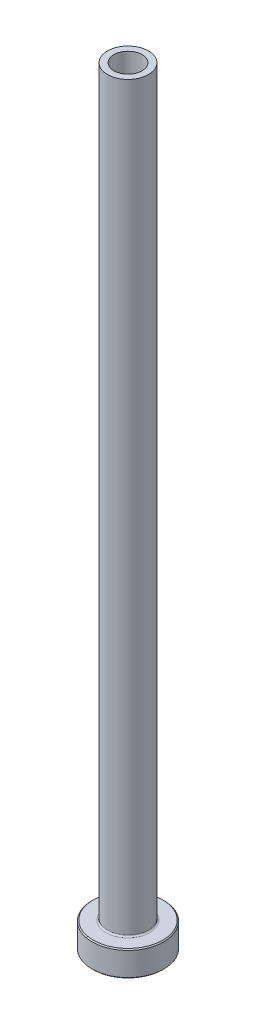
ISO-10303-21;
HEADER;
FILE_DESCRIPTION(('STEP AP214'),'2;1');
FILE_NAME('part.step','',(''),(''),'','','');
FILE_SCHEMA(('AUTOMOTIVE_DESIGN { 1 0 10303 214 1 1 1 1 }'));
ENDSEC;
DATA;
#1=APPLICATION_CONTEXT('core data for automotive mechanical design processes');
#2=APPLICATION_PROTOCOL_DEFINITION('international standard','automotive_design',2000,#1);
#3=PRODUCT_CONTEXT('',#1,'mechanical');
#4=PRODUCT('Part','Part','',(#3));
#5=PRODUCT_RELATED_PRODUCT_CATEGORY('part','',(#4));
#6=PRODUCT_DEFINITION_FORMATION('','',#4);
#7=PRODUCT_DEFINITION_CONTEXT('part definition',#1,'design');
#8=PRODUCT_DEFINITION('design','',#6,#7);
#9=PRODUCT_DEFINITION_SHAPE('','',#8);
#10=(LENGTH_UNIT() NAMED_UNIT(*) SI_UNIT(.MILLI.,.METRE.));
#11=(NAMED_UNIT(*) PLANE_ANGLE_UNIT() SI_UNIT($,.RADIAN.));
#12=(NAMED_UNIT(*) SI_UNIT($,.STERADIAN.) SOLID_ANGLE_UNIT());
#13=UNCERTAINTY_MEASURE_WITH_UNIT(LENGTH_MEASURE(1.E-05),#10,'distance_accuracy_value','');
#14=(GEOMETRIC_REPRESENTATION_CONTEXT(3) GLOBAL_UNCERTAINTY_ASSIGNED_CONTEXT((#13)) GLOBAL_UNIT_ASSIGNED_CONTEXT((#10,
#11,#12)) REPRESENTATION_CONTEXT('',''));
#15=CARTESIAN_POINT('',(0.,0.,0.));
#16=DIRECTION('',(0.,0.,1.));
#17=DIRECTION('',(1.,0.,0.));
#18=AXIS2_PLACEMENT_3D('',#15,#16,#17);
#19=CARTESIAN_POINT('',(0.,92.1876809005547,0.));
#20=DIRECTION('',(0.,1.,0.));
#21=DIRECTION('',(0.,0.,1.));
#22=AXIS2_PLACEMENT_3D('',#19,#20,#21);
#23=CYLINDRICAL_SURFACE('',#22,2.75);
#24=CARTESIAN_POINT('',(0.,150.,0.));
#25=DIRECTION('',(0.,1.,0.));
#26=DIRECTION('',(0.,0.,1.));
#27=AXIS2_PLACEMENT_3D('',#24,#25,#26);
#28=CIRCLE('',#27,2.75);
#29=CARTESIAN_POINT('',(0.,150.,2.75));
#30=VERTEX_POINT('',#29);
#31=EDGE_CURVE('E62',#30,#30,#28,.T.);
#32=ORIENTED_EDGE('',*,*,#31,.T.);
#33=EDGE_LOOP('',(#32));
#34=FACE_BOUND('',#33,.T.);
#35=CARTESIAN_POINT('',(0.,105.,0.));
#36=DIRECTION('',(0.,1.,0.));
#37=DIRECTION('',(0.,0.,1.));
#38=AXIS2_PLACEMENT_3D('',#35,#36,#37);
#39=CIRCLE('',#38,2.75);
#40=CARTESIAN_POINT('',(0.,105.,2.75));
#41=VERTEX_POINT('',#40);
#42=EDGE_CURVE('E71',#41,#41,#39,.T.);
#43=ORIENTED_EDGE('',*,*,#42,.F.);
#44=EDGE_LOOP('',(#43));
#45=FACE_BOUND('',#44,.T.);
#46=ADVANCED_FACE('F30',(#34,#45),#23,.F.);
#47=CARTESIAN_POINT('',(-2.75,150.,0.));
#48=DIRECTION('',(0.,1.,0.));
#49=DIRECTION('',(0.,0.,1.));
#50=AXIS2_PLACEMENT_3D('',#47,#48,#49);
#51=PLANE('',#50);
#52=CARTESIAN_POINT('',(0.,150.,0.));
#53=DIRECTION('',(0.,1.,0.));
#54=DIRECTION('',(0.,0.,1.));
#55=AXIS2_PLACEMENT_3D('',#52,#53,#54);
#56=CIRCLE('',#55,4.00000000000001);
#57=CARTESIAN_POINT('',(0.,150.,4.00000000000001));
#58=VERTEX_POINT('',#57);
#59=EDGE_CURVE('E65',#58,#58,#56,.T.);
#60=ORIENTED_EDGE('',*,*,#59,.T.);
#61=EDGE_LOOP('',(#60));
#62=FACE_BOUND('',#61,.T.);
#63=ORIENTED_EDGE('',*,*,#31,.F.);
#64=EDGE_LOOP('',(#63));
#65=FACE_BOUND('',#64,.T.);
#66=ADVANCED_FACE('F79',(#62,#65),#51,.T.);
#67=CARTESIAN_POINT('',(0.,92.1876809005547,0.));
#68=DIRECTION('',(0.,1.,0.));
#69=DIRECTION('',(0.,0.,1.));
#70=AXIS2_PLACEMENT_3D('',#67,#68,#69);
#71=CYLINDRICAL_SURFACE('',#70,4.);
#72=CARTESIAN_POINT('',(0.,5.3,0.));
#73=DIRECTION('',(0.,1.,0.));
#74=DIRECTION('',(0.,0.,1.));
#75=AXIS2_PLACEMENT_3D('',#72,#73,#74);
#76=CIRCLE('',#75,4.);
#77=CARTESIAN_POINT('',(0.,5.3,4.));
#78=VERTEX_POINT('',#77);
#79=EDGE_CURVE('E59',#78,#78,#76,.T.);
#80=ORIENTED_EDGE('',*,*,#79,.T.);
#81=EDGE_LOOP('',(#80));
#82=FACE_BOUND('',#81,.T.);
#83=ORIENTED_EDGE('',*,*,#59,.F.);
#84=EDGE_LOOP('',(#83));
#85=FACE_BOUND('',#84,.T.);
#86=ADVANCED_FACE('F85',(#82,#85),#71,.T.);
#87=CARTESIAN_POINT('',(-3.99999999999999,5.,0.));
#88=DIRECTION('',(0.,1.,0.));
#89=DIRECTION('',(0.,0.,1.));
#90=AXIS2_PLACEMENT_3D('',#87,#88,#89);
#91=PLANE('',#90);
#92=CARTESIAN_POINT('',(0.,5.,0.));
#93=DIRECTION('',(0.,1.,0.));
#94=DIRECTION('',(0.,0.,1.));
#95=AXIS2_PLACEMENT_3D('',#92,#93,#94);
#96=CIRCLE('',#95,6.8);
#97=CARTESIAN_POINT('',(0.,5.,6.8));
#98=VERTEX_POINT('',#97);
#99=EDGE_CURVE('E53',#98,#98,#96,.T.);
#100=ORIENTED_EDGE('',*,*,#99,.T.);
#101=EDGE_LOOP('',(#100));
#102=FACE_BOUND('',#101,.T.);
#103=CARTESIAN_POINT('',(0.,5.,0.));
#104=DIRECTION('',(0.,1.,0.));
#105=DIRECTION('',(0.,0.,1.));
#106=AXIS2_PLACEMENT_3D('',#103,#104,#105);
#107=CIRCLE('',#106,4.3);
#108=CARTESIAN_POINT('',(0.,5.,4.3));
#109=VERTEX_POINT('',#108);
#110=EDGE_CURVE('E56',#109,#109,#107,.F.);
#111=ORIENTED_EDGE('',*,*,#110,.T.);
#112=EDGE_LOOP('',(#111));
#113=FACE_BOUND('',#112,.T.);
#114=ADVANCED_FACE('F111',(#102,#113),#91,.T.);
#115=CARTESIAN_POINT('',(0.,92.1876809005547,0.));
#116=DIRECTION('',(0.,1.,0.));
#117=DIRECTION('',(0.,0.,1.));
#118=AXIS2_PLACEMENT_3D('',#115,#116,#117);
#119=CYLINDRICAL_SURFACE('',#118,6.99999999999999);
#120=CARTESIAN_POINT('',(0.,4.8,0.));
#121=DIRECTION('',(0.,1.,0.));
#122=DIRECTION('',(0.,0.,1.));
#123=AXIS2_PLACEMENT_3D('',#120,#121,#122);
#124=CIRCLE('',#123,6.99999999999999);
#125=CARTESIAN_POINT('',(0.,4.8,6.99999999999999));
#126=VERTEX_POINT('',#125);
#127=EDGE_CURVE('E45',#126,#126,#124,.F.);
#128=ORIENTED_EDGE('',*,*,#127,.T.);
#129=EDGE_LOOP('',(#128));
#130=FACE_BOUND('',#129,.T.);
#131=CARTESIAN_POINT('',(0.,0.200000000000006,0.));
#132=DIRECTION('',(0.,-1.,0.));
#133=DIRECTION('',(0.,0.,-1.));
#134=AXIS2_PLACEMENT_3D('',#131,#132,#133);
#135=CIRCLE('',#134,6.99999999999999);
#136=CARTESIAN_POINT('',(0.,0.200000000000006,-6.99999999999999));
#137=VERTEX_POINT('',#136);
#138=EDGE_CURVE('E50',#137,#137,#135,.F.);
#139=ORIENTED_EDGE('',*,*,#138,.T.);
#140=EDGE_LOOP('',(#139));
#141=FACE_BOUND('',#140,.T.);
#142=ADVANCED_FACE('F108',(#130,#141),#119,.T.);
#143=CARTESIAN_POINT('',(-6.99999999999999,0.,0.));
#144=DIRECTION('',(0.,-1.,0.));
#145=DIRECTION('',(0.,0.,-1.));
#146=AXIS2_PLACEMENT_3D('',#143,#144,#145);
#147=PLANE('',#146);
#148=CARTESIAN_POINT('',(0.,0.,0.));
#149=DIRECTION('',(0.,-1.,0.));
#150=DIRECTION('',(0.,0.,-1.));
#151=AXIS2_PLACEMENT_3D('',#148,#149,#150);
#152=CIRCLE('',#151,3.49999999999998);
#153=CARTESIAN_POINT('',(0.,0.,-3.49999999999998));
#154=VERTEX_POINT('',#153);
#155=EDGE_CURVE('E37',#154,#154,#152,.F.);
#156=ORIENTED_EDGE('',*,*,#155,.T.);
#157=EDGE_LOOP('',(#156));
#158=FACE_BOUND('',#157,.T.);
#159=CARTESIAN_POINT('',(0.,0.,0.));
#160=DIRECTION('',(0.,-1.,0.));
#161=DIRECTION('',(0.,0.,-1.));
#162=AXIS2_PLACEMENT_3D('',#159,#160,#161);
#163=CIRCLE('',#162,6.79999999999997);
#164=CARTESIAN_POINT('',(0.,0.,-6.79999999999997));
#165=VERTEX_POINT('',#164);
#166=EDGE_CURVE('E41',#165,#165,#163,.T.);
#167=ORIENTED_EDGE('',*,*,#166,.T.);
#168=EDGE_LOOP('',(#167));
#169=FACE_BOUND('',#168,.T.);
#170=ADVANCED_FACE('F110',(#158,#169),#147,.T.);
#171=CARTESIAN_POINT('',(0.,92.1876809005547,0.));
#172=DIRECTION('',(0.,1.,0.));
#173=DIRECTION('',(0.,0.,1.));
#174=AXIS2_PLACEMENT_3D('',#171,#172,#173);
#175=CYLINDRICAL_SURFACE('',#174,3.);
#176=CARTESIAN_POINT('',(0.,0.499999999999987,0.));
#177=DIRECTION('',(0.,-1.,0.));
#178=DIRECTION('',(0.,0.,-1.));
#179=AXIS2_PLACEMENT_3D('',#176,#177,#178);
#180=CIRCLE('',#179,3.);
#181=CARTESIAN_POINT('',(0.,0.499999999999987,-3.));
#182=VERTEX_POINT('',#181);
#183=EDGE_CURVE('E10',#182,#182,#180,.T.);
#184=ORIENTED_EDGE('',*,*,#183,.T.);
#185=EDGE_LOOP('',(#184));
#186=FACE_BOUND('',#185,.T.);
#187=CARTESIAN_POINT('',(0.,93.,0.));
#188=DIRECTION('',(0.,1.,0.));
#189=DIRECTION('',(0.,0.,1.));
#190=AXIS2_PLACEMENT_3D('',#187,#188,#189);
#191=CIRCLE('',#190,3.);
#192=CARTESIAN_POINT('',(0.,93.,3.));
#193=VERTEX_POINT('',#192);
#194=EDGE_CURVE('E68',#193,#193,#191,.T.);
#195=ORIENTED_EDGE('',*,*,#194,.T.);
#196=EDGE_LOOP('',(#195));
#197=FACE_BOUND('',#196,.T.);
#198=ADVANCED_FACE('F118',(#186,#197),#175,.F.);
#199=CARTESIAN_POINT('',(0.,93.,0.));
#200=DIRECTION('',(0.,-1.,0.));
#201=DIRECTION('',(0.,0.,-1.));
#202=AXIS2_PLACEMENT_3D('',#199,#200,#201);
#203=CONICAL_SURFACE('',#202,3.,0.0208303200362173);
#204=ORIENTED_EDGE('',*,*,#42,.T.);
#205=EDGE_LOOP('',(#204));
#206=FACE_BOUND('',#205,.T.);
#207=ORIENTED_EDGE('',*,*,#194,.F.);
#208=EDGE_LOOP('',(#207));
#209=FACE_BOUND('',#208,.T.);
#210=ADVANCED_FACE('F75',(#206,#209),#203,.F.);
#211=CARTESIAN_POINT('',(0.,5.3,0.));
#212=DIRECTION('',(0.,1.,0.));
#213=DIRECTION('',(0.,0.,1.));
#214=AXIS2_PLACEMENT_3D('',#211,#212,#213);
#215=TOROIDAL_SURFACE('',#214,4.3,0.3);
#216=ORIENTED_EDGE('',*,*,#110,.F.);
#217=EDGE_LOOP('',(#216));
#218=FACE_BOUND('',#217,.T.);
#219=ORIENTED_EDGE('',*,*,#79,.F.);
#220=EDGE_LOOP('',(#219));
#221=FACE_BOUND('',#220,.T.);
#222=ADVANCED_FACE('F90',(#218,#221),#215,.F.);
#223=CARTESIAN_POINT('',(0.,5.,0.));
#224=DIRECTION('',(0.,-1.,0.));
#225=DIRECTION('',(0.,0.,-1.));
#226=AXIS2_PLACEMENT_3D('',#223,#224,#225);
#227=CONICAL_SURFACE('',#226,6.8,0.785398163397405);
#228=ORIENTED_EDGE('',*,*,#127,.F.);
#229=EDGE_LOOP('',(#228));
#230=FACE_BOUND('',#229,.T.);
#231=ORIENTED_EDGE('',*,*,#99,.F.);
#232=EDGE_LOOP('',(#231));
#233=FACE_BOUND('',#232,.T.);
#234=ADVANCED_FACE('F93',(#230,#233),#227,.T.);
#235=CARTESIAN_POINT('',(0.,0.200000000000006,0.));
#236=DIRECTION('',(0.,1.,0.));
#237=DIRECTION('',(0.,0.,1.));
#238=AXIS2_PLACEMENT_3D('',#235,#236,#237);
#239=CONICAL_SURFACE('',#238,6.99999999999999,0.785398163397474);
#240=ORIENTED_EDGE('',*,*,#166,.F.);
#241=EDGE_LOOP('',(#240));
#242=FACE_BOUND('',#241,.T.);
#243=ORIENTED_EDGE('',*,*,#138,.F.);
#244=EDGE_LOOP('',(#243));
#245=FACE_BOUND('',#244,.T.);
#246=ADVANCED_FACE('F96',(#242,#245),#239,.T.);
#247=CARTESIAN_POINT('',(0.,0.,0.));
#248=DIRECTION('',(0.,-1.,0.));
#249=DIRECTION('',(0.,0.,-1.));
#250=AXIS2_PLACEMENT_3D('',#247,#248,#249);
#251=CONICAL_SURFACE('',#250,3.49999999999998,0.785398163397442);
#252=ORIENTED_EDGE('',*,*,#183,.F.);
#253=EDGE_LOOP('',(#252));
#254=FACE_BOUND('',#253,.T.);
#255=ORIENTED_EDGE('',*,*,#155,.F.);
#256=EDGE_LOOP('',(#255));
#257=FACE_BOUND('',#256,.T.);
#258=ADVANCED_FACE('F32',(#254,#257),#251,.F.);
#259=CLOSED_SHELL('',(#46,#66,#86,#114,#142,#170,#198,#210,#222,#234,#246,#258));
#260=MANIFOLD_SOLID_BREP('B2',#259);
#261=ADVANCED_BREP_SHAPE_REPRESENTATION('',(#18,#260),#14);
#262=SHAPE_DEFINITION_REPRESENTATION(#9,#261);
ENDSEC;
END-ISO-10303-21;
